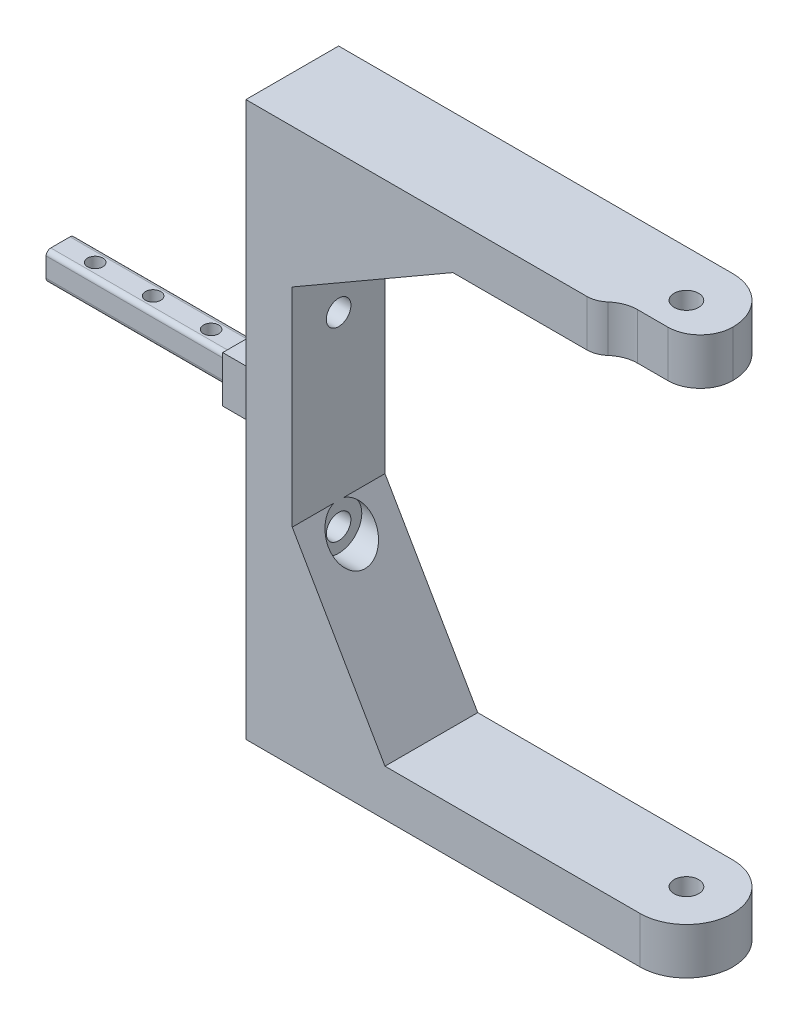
from build123d import *
from OCP.BRepFilletAPI import BRepFilletAPI_MakeChamfer, BRepFilletAPI_MakeFillet

# Parameters (mm, degrees)
EXTRUDE_1_DEPTH     = 20
EXTRUDE_2_DEPTH     = 10
EXTRUDE_START       = 10
EXTRUDE_3_DEPTH     = 40
CUT_EXTRUDE_1_DEPTH = 149.00422291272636
FILLET_1_R          = 1
SKETCH_7_R          = 1.6500000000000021
SKETCH_7_R_2        = 1.6499999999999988
CUT_EXTRUDE_2_DEPTH = 108.57314081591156
CHAMFER_1_SIZE      = 20.000000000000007
CHAMFER_1_SIZE2     = 34.64101615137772
CUT_EXTRUDE_3_REACH = 150.004
FILLET_2_R1         = 5
FILLET_2_R2         = 7
CUT_EXTRUDE_4_REACH = 115.996
CUT_EXTRUDE_START   = -15.710581
CUT_EXTRUDE_5_DEPTH = 5.7105809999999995


with BuildPart() as part:
    # Sketch 1 → Extrude 1 (new body)
    with BuildSketch(Plane.XY):
        Polygon((-1.953e-14, 49.75), (1.093e-14, -49.75), (85.00000000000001, -49.74999999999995), (85.00000000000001, -59.74999999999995), (-9.999999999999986, -59.74999999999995), (-9.999999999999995, 59.749999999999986), (85, 59.75000000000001), (84.99999999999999, 49.75), align=None)
    extrude(amount=EXTRUDE_1_DEPTH)

    # Sketch 3 → Extrude 2 (add)
    # profile 1 of 2: a face of its own
    with BuildSketch(Plane.ZY.offset(9.99999999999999)):
        Polygon((15, 5.000000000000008), (15, -4.999999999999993), (5.000000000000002, -4.999999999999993), (5, 5.000000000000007), align=None)
        Polygon((6.925000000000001, 3.075000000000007), (6.925000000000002, -3.074999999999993), (13.075, -3.074999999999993), (13.075, 3.075000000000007), align=None, mode=Mode.SUBTRACT)
    # profile 2 of 2: a face of its own
    with BuildSketch(Plane.ZY.offset(9.99999999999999)):
        Polygon((6.925000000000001, 3.075000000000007), (13.075, 3.075000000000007), (13.075, -3.074999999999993), (6.925000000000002, -3.074999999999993), align=None)
    extrude(amount=EXTRUDE_2_DEPTH)

    # Sketch 3_3 → Extrude 3 (add)
    with BuildSketch(Plane.ZY.offset(9.99999999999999).offset(EXTRUDE_START)):
        Polygon((6.925000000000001, 3.075000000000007), (13.075, 3.075000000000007), (13.075, -3.074999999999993), (6.925000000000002, -3.074999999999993), align=None)
    extrude(amount=EXTRUDE_3_DEPTH)

    # Sketch 5 → Cut-Extrude 1 (cut, through all)
    with BuildSketch(Plane(origin=(-1.309e-14, 59.749999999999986, 0), x_dir=(1, 2.3e-16, 0), z_dir=(-2.3e-16, 1, 0))):
        with BuildLine():
            ThreePointArc((72.34999999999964, -10), (74.99999999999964, -12.65), (77.64999999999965, -10))
            Line((77.64999999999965, -9.99999999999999), (72.34999999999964, -9.999999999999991))
        make_face()
        with BuildLine():
            Line((72.34999999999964, -9.999999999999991), (77.64999999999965, -9.99999999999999))
            ThreePointArc((77.64999999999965, -10), (74.99999999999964, -7.35), (72.34999999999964, -9.999999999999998))
        make_face()
        with BuildLine():
            ThreePointArc((72.34999999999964, -10), (74.99999999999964, -12.65), (77.64999999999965, -10))
            Line((77.64999999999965, -9.99999999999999), (72.34999999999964, -9.999999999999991))
        make_face()
        with BuildLine():
            Line((72.34999999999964, -9.999999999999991), (77.64999999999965, -9.99999999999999))
            ThreePointArc((77.64999999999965, -10), (74.99999999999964, -7.35), (72.34999999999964, -9.999999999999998))
        make_face()
        with BuildLine():
            Line((85.00000000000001, -20), (85.00000000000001, -9.999999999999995))
            ThreePointArc((84.99999999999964, -10.000000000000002), (82.07106781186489, -17.071067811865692), (74.99999999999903, -19.999999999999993))
            Line((74.99999999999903, -20), (85.00000000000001, -20))
        make_face()
        with BuildLine():
            ThreePointArc((74.99999999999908, -5.33e-15), (82.07106781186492, -2.928932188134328), (84.99999999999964, -10))
            Line((85.00000000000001, -9.999999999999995), (85.00000000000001, 0))
            Line((85.00000000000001, 0), (74.99999999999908, 0))
        make_face()
    extrude(amount=-CUT_EXTRUDE_1_DEPTH, mode=Mode.SUBTRACT)

    # Fillet 1
    fillet_1_edges = [part.edges().sort_by_distance(p)[0] for p in [
        (-39.999999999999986, -3.0749999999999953, 6.925000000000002),
        (-39.999999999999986, -3.0749999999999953, 13.075),
        (-39.999999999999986, 3.0750000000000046, 13.075),
        (-39.999999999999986, 3.0750000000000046, 6.925000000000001),
    ]]
    fillet(fillet_1_edges, radius=FILLET_1_R)

    # Sketch 7 → Cut-Extrude 2 (cut, through all)
    with BuildSketch(Plane(origin=(-1.6e-16, 3.0750000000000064, 0), x_dir=(1, 5e-17, 0), z_dir=(-5e-17, 1, 0))):
        with Locations(Location((-39.99999999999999, -10, 0), (0, 0, 180))):
            Circle(SKETCH_7_R)
        with Locations(Location((-52.49999999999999, -10.000000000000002, 0), (0, 0, 180))):
            Circle(SKETCH_7_R)
        with Locations(Location((-27.499999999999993, -9.999999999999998, 0), (0, 0, 180))):
            Circle(SKETCH_7_R_2)
    extrude(amount=-CUT_EXTRUDE_2_DEPTH, mode=Mode.SUBTRACT)

    # Chamfer 1: one chamfer whose edges measure the first distance from different faces: ONE call of the kernel's chamfer builder (chamfer() names one face for all edges)
    chamfer_1_edges_1 = [part.edges().sort_by_distance(p)[0] for p in [
        (-1.953e-14, 49.75, 10),
    ]]
    chamfer_1_side_1 = [part.faces().sort_by_distance(p)[0] for p in [
        (-4.3e-15, -1.94e-15, 10),
    ]]
    chamfer_1_edges_2 = [part.edges().sort_by_distance(p)[0] for p in [
        (1.093e-14, -49.75, 10),
    ]]
    chamfer_1_side_2 = [part.faces().sort_by_distance(p)[0] for p in [
        (41.004447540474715, -49.74999999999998, 9.99999999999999),
    ]]
    chamfer_1 = BRepFilletAPI_MakeChamfer(part.part.solid().wrapped)
    for e in chamfer_1_edges_1:
        chamfer_1.Add(CHAMFER_1_SIZE, CHAMFER_1_SIZE2, e.wrapped, chamfer_1_side_1[0].wrapped)  # the first distance lies on this face
    for e in chamfer_1_edges_2:
        chamfer_1.Add(CHAMFER_1_SIZE, CHAMFER_1_SIZE2, e.wrapped, chamfer_1_side_2[0].wrapped)  # the first distance lies on this face
    add(Compound.cast(chamfer_1.Shape()), mode=Mode.REPLACE)

    # Sketch 8 → Cut-Extrude 3 (cut, up to next)
    with BuildSketch(Plane(origin=(-1.309e-14, 59.749999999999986, 0), x_dir=(1, 2.2e-16, 0), z_dir=(-2.2e-16, 1, 0)), mode=Mode.PRIVATE) as cut_extrude_3_sk1:
        with BuildLine():
            ThreePointArc((74.99999999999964, -20), (78.87298334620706, -19.219544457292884), (82.14142842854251, -16.99999999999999))
            Line((82.14142842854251, -16.999999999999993), (71.47264625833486, -16.999999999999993))
            ThreePointArc((71.47264625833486, -16.999999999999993), (68.23227590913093, -17.795163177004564), (65.72808361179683, -20.000000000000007))
            Line((65.72808361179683, -20), (74.99999999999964, -20))
        make_face()
    cut_extrude_3_tool1 = extrude(cut_extrude_3_sk1.sketch, amount=-CUT_EXTRUDE_3_REACH, mode=Mode.PRIVATE) & part.part
    add(cut_extrude_3_tool1.solids().sort_by_distance((73.723085, 59.75, 18.477053))[0], mode=Mode.SUBTRACT)

    # Fillet 2: one fillet with a radius per group of edges: ONE call of the kernel's fillet builder (fillet() takes one radius for all edges)
    fillet_2_edges_1 = [part.edges().sort_by_distance(p)[0] for p in [
        (65.72808361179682, 54.75, 20.000000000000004),
    ]]
    fillet_2_edges_2 = [part.edges().sort_by_distance(p)[0] for p in [
        (82.1414284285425, 54.75, 16.999999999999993),
    ]]
    fillet_2 = BRepFilletAPI_MakeFillet(part.part.solid().wrapped)
    for e in fillet_2_edges_1:
        fillet_2.Add(FILLET_2_R1, e.wrapped)
    for e in fillet_2_edges_2:
        fillet_2.Add(FILLET_2_R2, e.wrapped)
    add(Compound.cast(fillet_2.Shape()), mode=Mode.REPLACE)

    # Sketch 10 → Cut-Extrude 4 (cut, up to next)
    with BuildSketch(Plane.ZY.offset(9.99999999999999), mode=Mode.PRIVATE) as cut_extrude_4_sk1:
        with BuildLine():
            ThreePointArc((12.649999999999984, 20.00000000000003), (11.873832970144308, 21.873832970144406), (9.999999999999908, 22.650000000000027))
            Line((9.999999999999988, 22.650000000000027), (9.999999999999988, 20.00000000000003))
            Line((9.999999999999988, 20.00000000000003), (9.99999999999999, 17.35000000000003))
            ThreePointArc((9.999999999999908, 17.35000000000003), (11.873832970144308, 18.12616702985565), (12.649999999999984, 20.00000000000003))
        make_face()
    cut_extrude_4_tool1 = extrude(cut_extrude_4_sk1.sketch, amount=-CUT_EXTRUDE_4_REACH, mode=Mode.PRIVATE) & part.part
    # Sketch 10 → Cut-Extrude 4 (cut, up to next)
    with BuildSketch(Plane.ZY.offset(9.99999999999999), mode=Mode.PRIVATE) as cut_extrude_4_sk2:
        with BuildLine():
            Line((9.999999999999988, 20.00000000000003), (9.999999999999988, 22.650000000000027))
            ThreePointArc((9.999999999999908, 22.650000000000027), (7.349999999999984, 20.00000000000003), (9.999999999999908, 17.35000000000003))
            Line((9.99999999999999, 17.35000000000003), (9.999999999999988, 20.00000000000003))
        make_face()
    cut_extrude_4_tool2 = extrude(cut_extrude_4_sk2.sketch, amount=-CUT_EXTRUDE_4_REACH, mode=Mode.PRIVATE) & part.part
    # Sketch 10 → Cut-Extrude 4 (cut, up to next)
    with BuildSketch(Plane.ZY.offset(9.99999999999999), mode=Mode.PRIVATE) as cut_extrude_4_sk3:
        with BuildLine():
            ThreePointArc((12.649999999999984, 20.00000000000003), (11.873832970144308, 21.873832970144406), (9.999999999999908, 22.650000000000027))
            Line((9.999999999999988, 22.650000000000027), (9.999999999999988, 20.00000000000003))
            Line((9.999999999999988, 20.00000000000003), (9.99999999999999, 17.35000000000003))
            ThreePointArc((9.999999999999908, 17.35000000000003), (11.873832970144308, 18.12616702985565), (12.649999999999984, 20.00000000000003))
        make_face()
    cut_extrude_4_tool3 = extrude(cut_extrude_4_sk3.sketch, amount=-CUT_EXTRUDE_4_REACH, mode=Mode.PRIVATE) & part.part
    # Sketch 10 → Cut-Extrude 4 (cut, up to next)
    with BuildSketch(Plane.ZY.offset(9.99999999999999), mode=Mode.PRIVATE) as cut_extrude_4_sk4:
        with BuildLine():
            Line((9.999999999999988, 20.00000000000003), (9.999999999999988, 22.650000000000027))
            ThreePointArc((9.999999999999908, 22.650000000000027), (7.349999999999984, 20.00000000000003), (9.999999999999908, 17.35000000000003))
            Line((9.99999999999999, 17.35000000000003), (9.999999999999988, 20.00000000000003))
        make_face()
    cut_extrude_4_tool4 = extrude(cut_extrude_4_sk4.sketch, amount=-CUT_EXTRUDE_4_REACH, mode=Mode.PRIVATE) & part.part
    # Sketch 10 → Cut-Extrude 4 (cut, up to next)
    with BuildSketch(Plane.ZY.offset(9.99999999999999), mode=Mode.PRIVATE) as cut_extrude_4_sk5:
        with BuildLine():
            ThreePointArc((12.649999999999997, -19.99999999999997), (11.873832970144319, -18.12616702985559), (9.999999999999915, -17.349999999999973))
            Line((9.999999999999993, -17.349999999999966), (9.999999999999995, -19.99999999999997))
            Line((9.999999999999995, -19.99999999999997), (9.999999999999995, -22.649999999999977))
            ThreePointArc((9.999999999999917, -22.64999999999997), (11.873832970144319, -21.873832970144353), (12.649999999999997, -19.99999999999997))
        make_face()
    cut_extrude_4_tool5 = extrude(cut_extrude_4_sk5.sketch, amount=-CUT_EXTRUDE_4_REACH, mode=Mode.PRIVATE) & part.part
    # Sketch 10 → Cut-Extrude 4 (cut, up to next)
    with BuildSketch(Plane.ZY.offset(9.99999999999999), mode=Mode.PRIVATE) as cut_extrude_4_sk6:
        with BuildLine():
            Line((9.999999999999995, -19.99999999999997), (9.999999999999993, -17.349999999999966))
            ThreePointArc((9.999999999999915, -17.349999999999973), (7.349999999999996, -19.99999999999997), (9.999999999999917, -22.64999999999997))
            Line((9.999999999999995, -22.649999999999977), (9.999999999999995, -19.99999999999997))
        make_face()
    cut_extrude_4_tool6 = extrude(cut_extrude_4_sk6.sketch, amount=-CUT_EXTRUDE_4_REACH, mode=Mode.PRIVATE) & part.part
    # Sketch 10 → Cut-Extrude 4 (cut, up to next)
    with BuildSketch(Plane.ZY.offset(9.99999999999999), mode=Mode.PRIVATE) as cut_extrude_4_sk7:
        with BuildLine():
            ThreePointArc((12.649999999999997, -19.99999999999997), (11.873832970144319, -18.12616702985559), (9.999999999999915, -17.349999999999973))
            Line((9.999999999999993, -17.349999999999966), (9.999999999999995, -19.99999999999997))
            Line((9.999999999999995, -19.99999999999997), (9.999999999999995, -22.649999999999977))
            ThreePointArc((9.999999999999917, -22.64999999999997), (11.873832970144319, -21.873832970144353), (12.649999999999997, -19.99999999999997))
        make_face()
    cut_extrude_4_tool7 = extrude(cut_extrude_4_sk7.sketch, amount=-CUT_EXTRUDE_4_REACH, mode=Mode.PRIVATE) & part.part
    # Sketch 10 → Cut-Extrude 4 (cut, up to next)
    with BuildSketch(Plane.ZY.offset(9.99999999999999), mode=Mode.PRIVATE) as cut_extrude_4_sk8:
        with BuildLine():
            Line((9.999999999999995, -19.99999999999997), (9.999999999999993, -17.349999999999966))
            ThreePointArc((9.999999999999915, -17.349999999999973), (7.349999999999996, -19.99999999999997), (9.999999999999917, -22.64999999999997))
            Line((9.999999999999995, -22.649999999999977), (9.999999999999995, -19.99999999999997))
        make_face()
    cut_extrude_4_tool8 = extrude(cut_extrude_4_sk8.sketch, amount=-CUT_EXTRUDE_4_REACH, mode=Mode.PRIVATE) & part.part
    add(cut_extrude_4_tool1.solids().sort_by_distance((-10, 20, 11.124695))[0], mode=Mode.SUBTRACT)
    add(cut_extrude_4_tool2.solids().sort_by_distance((-10, 20, 8.875305))[0], mode=Mode.SUBTRACT)
    add(cut_extrude_4_tool3.solids().sort_by_distance((-10, 20, 11.124695))[0], mode=Mode.SUBTRACT)
    add(cut_extrude_4_tool4.solids().sort_by_distance((-10, 20, 8.875305))[0], mode=Mode.SUBTRACT)
    add(cut_extrude_4_tool5.solids().sort_by_distance((-10, -20, 11.124695))[0], mode=Mode.SUBTRACT)
    add(cut_extrude_4_tool6.solids().sort_by_distance((-10, -20, 8.875305))[0], mode=Mode.SUBTRACT)
    add(cut_extrude_4_tool7.solids().sort_by_distance((-10, -20, 11.124695))[0], mode=Mode.SUBTRACT)
    add(cut_extrude_4_tool8.solids().sort_by_distance((-10, -20, 8.875305))[0], mode=Mode.SUBTRACT)

    # Sketch 10_3 → Cut-Extrude 5 (cut)
    with BuildSketch(Plane.ZY.offset(9.99999999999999).offset(CUT_EXTRUDE_START)):
        with BuildLine():
            ThreePointArc((14.999999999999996, -19.99999999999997), (13.535533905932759, -16.46446609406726), (10.000000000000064, -14.999999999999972))
            Line((9.999999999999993, -14.999999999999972), (9.999999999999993, -17.349999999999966))
            ThreePointArc((9.999999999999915, -17.349999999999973), (11.873832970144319, -18.12616702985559), (12.649999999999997, -19.99999999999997))
            ThreePointArc((12.649999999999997, -19.99999999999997), (11.873832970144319, -21.873832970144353), (9.999999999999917, -22.64999999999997))
            Line((9.999999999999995, -22.649999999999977), (9.999999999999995, -24.99999999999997))
            ThreePointArc((10.000000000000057, -24.99999999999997), (13.535533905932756, -23.535533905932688), (14.999999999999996, -19.99999999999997))
        make_face()
        with BuildLine():
            Line((9.999999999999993, -17.349999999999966), (9.999999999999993, -14.999999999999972))
            ThreePointArc((10.000000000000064, -14.999999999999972), (4.999999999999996, -19.999999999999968), (10.000000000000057, -24.99999999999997))
            Line((9.999999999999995, -24.99999999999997), (9.999999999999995, -22.649999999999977))
            ThreePointArc((9.999999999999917, -22.64999999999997), (7.349999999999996, -19.99999999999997), (9.999999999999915, -17.349999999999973))
        make_face()
        with BuildLine():
            ThreePointArc((14.999999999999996, -19.99999999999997), (13.535533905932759, -16.46446609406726), (10.000000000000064, -14.999999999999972))
            Line((9.999999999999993, -14.999999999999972), (9.999999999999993, -17.349999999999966))
            ThreePointArc((9.999999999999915, -17.349999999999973), (11.873832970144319, -18.12616702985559), (12.649999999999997, -19.99999999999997))
            ThreePointArc((12.649999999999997, -19.99999999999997), (11.873832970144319, -21.873832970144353), (9.999999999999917, -22.64999999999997))
            Line((9.999999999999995, -22.649999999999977), (9.999999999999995, -24.99999999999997))
            ThreePointArc((10.000000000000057, -24.99999999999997), (13.535533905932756, -23.535533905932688), (14.999999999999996, -19.99999999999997))
        make_face()
        with BuildLine():
            Line((9.999999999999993, -17.349999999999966), (9.999999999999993, -14.999999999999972))
            ThreePointArc((10.000000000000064, -14.999999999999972), (4.999999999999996, -19.999999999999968), (10.000000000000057, -24.99999999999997))
            Line((9.999999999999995, -24.99999999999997), (9.999999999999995, -22.649999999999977))
            ThreePointArc((9.999999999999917, -22.64999999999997), (7.349999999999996, -19.99999999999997), (9.999999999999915, -17.349999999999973))
        make_face()
    extrude(amount=CUT_EXTRUDE_5_DEPTH, mode=Mode.SUBTRACT)


solid = part.part
